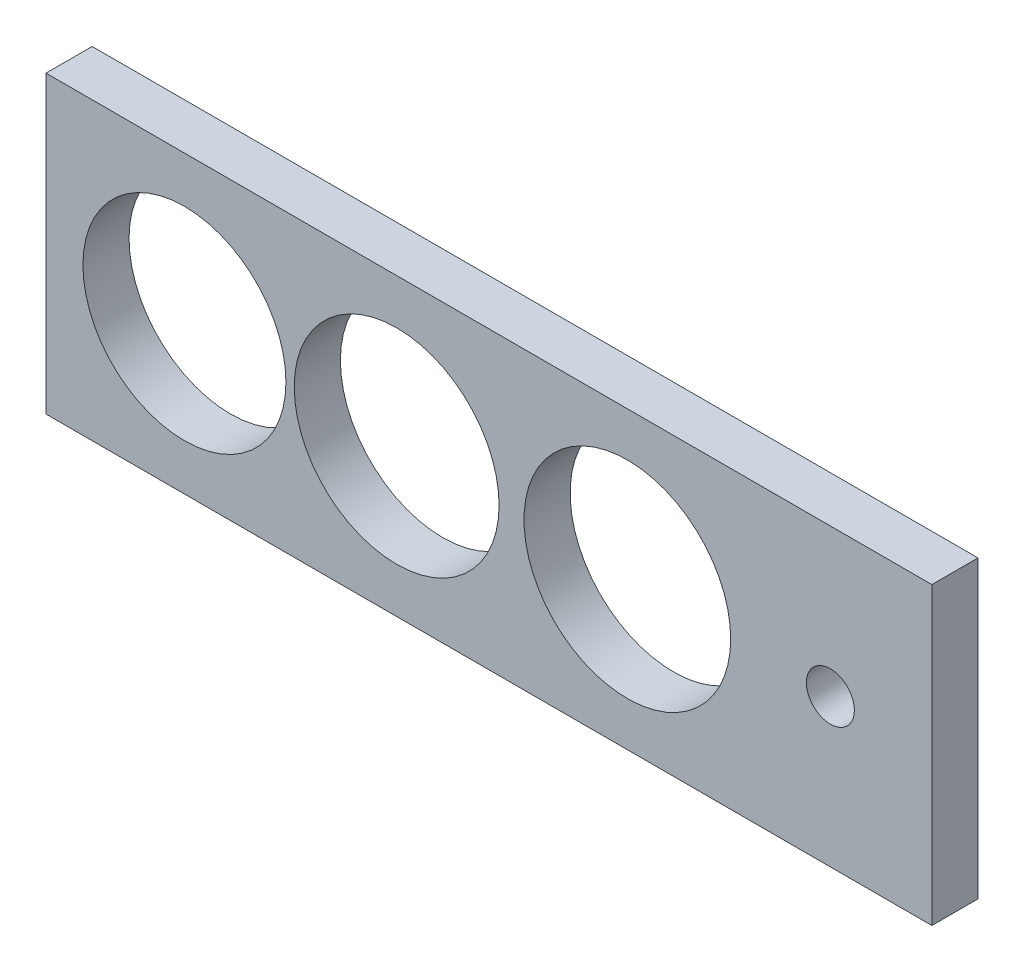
ISO-10303-21;
HEADER;
FILE_DESCRIPTION(('STEP AP214'),'2;1');
FILE_NAME('part.step','',(''),(''),'','','');
FILE_SCHEMA(('AUTOMOTIVE_DESIGN { 1 0 10303 214 1 1 1 1 }'));
ENDSEC;
DATA;
#1=APPLICATION_CONTEXT('core data for automotive mechanical design processes');
#2=APPLICATION_PROTOCOL_DEFINITION('international standard','automotive_design',2000,#1);
#3=PRODUCT_CONTEXT('',#1,'mechanical');
#4=PRODUCT('Part','Part','',(#3));
#5=PRODUCT_RELATED_PRODUCT_CATEGORY('part','',(#4));
#6=PRODUCT_DEFINITION_FORMATION('','',#4);
#7=PRODUCT_DEFINITION_CONTEXT('part definition',#1,'design');
#8=PRODUCT_DEFINITION('design','',#6,#7);
#9=PRODUCT_DEFINITION_SHAPE('','',#8);
#10=(LENGTH_UNIT() NAMED_UNIT(*) SI_UNIT(.MILLI.,.METRE.));
#11=(NAMED_UNIT(*) PLANE_ANGLE_UNIT() SI_UNIT($,.RADIAN.));
#12=(NAMED_UNIT(*) SI_UNIT($,.STERADIAN.) SOLID_ANGLE_UNIT());
#13=UNCERTAINTY_MEASURE_WITH_UNIT(LENGTH_MEASURE(1.E-05),#10,'distance_accuracy_value','');
#14=(GEOMETRIC_REPRESENTATION_CONTEXT(3) GLOBAL_UNCERTAINTY_ASSIGNED_CONTEXT((#13)) GLOBAL_UNIT_ASSIGNED_CONTEXT((#10,
#11,#12)) REPRESENTATION_CONTEXT('',''));
#15=CARTESIAN_POINT('',(0.,0.,0.));
#16=DIRECTION('',(0.,0.,1.));
#17=DIRECTION('',(1.,0.,0.));
#18=AXIS2_PLACEMENT_3D('',#15,#16,#17);
#19=CARTESIAN_POINT('',(37.,0.,0.));
#20=DIRECTION('',(0.,0.,-1.));
#21=DIRECTION('',(1.,0.,0.));
#22=AXIS2_PLACEMENT_3D('',#19,#20,#21);
#23=CYLINDRICAL_SURFACE('',#22,2.6);
#24=CARTESIAN_POINT('',(37.,0.,5.));
#25=DIRECTION('',(0.,0.,1.));
#26=DIRECTION('',(1.,0.,0.));
#27=AXIS2_PLACEMENT_3D('',#24,#25,#26);
#28=CIRCLE('',#27,2.6);
#29=CARTESIAN_POINT('',(39.6,0.,5.));
#30=VERTEX_POINT('',#29);
#31=EDGE_CURVE('E106',#30,#30,#28,.T.);
#32=ORIENTED_EDGE('',*,*,#31,.T.);
#33=EDGE_LOOP('',(#32));
#34=FACE_BOUND('',#33,.T.);
#35=CARTESIAN_POINT('',(37.,0.,0.));
#36=DIRECTION('',(0.,0.,1.));
#37=DIRECTION('',(1.,0.,0.));
#38=AXIS2_PLACEMENT_3D('',#35,#36,#37);
#39=CIRCLE('',#38,2.6);
#40=CARTESIAN_POINT('',(39.6,0.,0.));
#41=VERTEX_POINT('',#40);
#42=EDGE_CURVE('E10',#41,#41,#39,.T.);
#43=ORIENTED_EDGE('',*,*,#42,.F.);
#44=EDGE_LOOP('',(#43));
#45=FACE_BOUND('',#44,.T.);
#46=ADVANCED_FACE('F16',(#34,#45),#23,.F.);
#47=CARTESIAN_POINT('',(15.,0.,0.));
#48=DIRECTION('',(0.,0.,-1.));
#49=DIRECTION('',(1.,0.,0.));
#50=AXIS2_PLACEMENT_3D('',#47,#48,#49);
#51=CYLINDRICAL_SURFACE('',#50,11.2);
#52=CARTESIAN_POINT('',(15.,0.,5.));
#53=DIRECTION('',(0.,0.,1.));
#54=DIRECTION('',(1.,0.,0.));
#55=AXIS2_PLACEMENT_3D('',#52,#53,#54);
#56=CIRCLE('',#55,11.2);
#57=CARTESIAN_POINT('',(26.2,0.,5.));
#58=VERTEX_POINT('',#57);
#59=EDGE_CURVE('E109',#58,#58,#56,.T.);
#60=ORIENTED_EDGE('',*,*,#59,.T.);
#61=EDGE_LOOP('',(#60));
#62=FACE_BOUND('',#61,.T.);
#63=CARTESIAN_POINT('',(15.,0.,0.));
#64=DIRECTION('',(0.,0.,1.));
#65=DIRECTION('',(1.,0.,0.));
#66=AXIS2_PLACEMENT_3D('',#63,#64,#65);
#67=CIRCLE('',#66,11.2);
#68=CARTESIAN_POINT('',(26.2,0.,0.));
#69=VERTEX_POINT('',#68);
#70=EDGE_CURVE('E25',#69,#69,#67,.T.);
#71=ORIENTED_EDGE('',*,*,#70,.F.);
#72=EDGE_LOOP('',(#71));
#73=FACE_BOUND('',#72,.T.);
#74=ADVANCED_FACE('F18',(#62,#73),#51,.F.);
#75=CARTESIAN_POINT('',(-10.,0.,0.));
#76=DIRECTION('',(0.,0.,-1.));
#77=DIRECTION('',(1.,0.,0.));
#78=AXIS2_PLACEMENT_3D('',#75,#76,#77);
#79=CYLINDRICAL_SURFACE('',#78,11.1);
#80=CARTESIAN_POINT('',(-10.,0.,5.));
#81=DIRECTION('',(0.,0.,1.));
#82=DIRECTION('',(1.,0.,0.));
#83=AXIS2_PLACEMENT_3D('',#80,#81,#82);
#84=CIRCLE('',#83,11.1);
#85=CARTESIAN_POINT('',(1.1,0.,5.));
#86=VERTEX_POINT('',#85);
#87=EDGE_CURVE('E112',#86,#86,#84,.T.);
#88=ORIENTED_EDGE('',*,*,#87,.T.);
#89=EDGE_LOOP('',(#88));
#90=FACE_BOUND('',#89,.T.);
#91=CARTESIAN_POINT('',(-10.,0.,0.));
#92=DIRECTION('',(0.,0.,1.));
#93=DIRECTION('',(1.,0.,0.));
#94=AXIS2_PLACEMENT_3D('',#91,#92,#93);
#95=CIRCLE('',#94,11.1);
#96=CARTESIAN_POINT('',(1.1,0.,0.));
#97=VERTEX_POINT('',#96);
#98=EDGE_CURVE('E142',#97,#97,#95,.T.);
#99=ORIENTED_EDGE('',*,*,#98,.F.);
#100=EDGE_LOOP('',(#99));
#101=FACE_BOUND('',#100,.T.);
#102=ADVANCED_FACE('F152',(#90,#101),#79,.F.);
#103=CARTESIAN_POINT('',(-33.,0.,0.));
#104=DIRECTION('',(0.,0.,-1.));
#105=DIRECTION('',(1.,0.,0.));
#106=AXIS2_PLACEMENT_3D('',#103,#104,#105);
#107=CYLINDRICAL_SURFACE('',#106,11.);
#108=CARTESIAN_POINT('',(-33.,0.,5.));
#109=DIRECTION('',(0.,0.,1.));
#110=DIRECTION('',(1.,0.,0.));
#111=AXIS2_PLACEMENT_3D('',#108,#109,#110);
#112=CIRCLE('',#111,11.);
#113=CARTESIAN_POINT('',(-22.,0.,5.));
#114=VERTEX_POINT('',#113);
#115=EDGE_CURVE('E111',#114,#114,#112,.T.);
#116=ORIENTED_EDGE('',*,*,#115,.T.);
#117=EDGE_LOOP('',(#116));
#118=FACE_BOUND('',#117,.T.);
#119=CARTESIAN_POINT('',(-33.,0.,0.));
#120=DIRECTION('',(0.,0.,1.));
#121=DIRECTION('',(1.,0.,0.));
#122=AXIS2_PLACEMENT_3D('',#119,#120,#121);
#123=CIRCLE('',#122,11.);
#124=CARTESIAN_POINT('',(-22.,0.,0.));
#125=VERTEX_POINT('',#124);
#126=EDGE_CURVE('E130',#125,#125,#123,.T.);
#127=ORIENTED_EDGE('',*,*,#126,.F.);
#128=EDGE_LOOP('',(#127));
#129=FACE_BOUND('',#128,.T.);
#130=ADVANCED_FACE('F161',(#118,#129),#107,.F.);
#131=CARTESIAN_POINT('',(48.,-16.,0.));
#132=DIRECTION('',(1.,0.,0.));
#133=DIRECTION('',(0.,1.,0.));
#134=AXIS2_PLACEMENT_3D('',#131,#132,#133);
#135=PLANE('',#134);
#136=DIRECTION('',(0.,0.,1.));
#137=VECTOR('',#136,1.);
#138=CARTESIAN_POINT('',(48.,-16.,0.));
#139=LINE('',#138,#137);
#140=CARTESIAN_POINT('',(48.,-16.,0.));
#141=VERTEX_POINT('',#140);
#142=CARTESIAN_POINT('',(48.,-16.,5.));
#143=VERTEX_POINT('',#142);
#144=EDGE_CURVE('E80',#141,#143,#139,.T.);
#145=ORIENTED_EDGE('',*,*,#144,.F.);
#146=DIRECTION('',(0.,1.,0.));
#147=VECTOR('',#146,1.);
#148=CARTESIAN_POINT('',(48.,-16.,0.));
#149=LINE('',#148,#147);
#150=CARTESIAN_POINT('',(48.,16.,0.));
#151=VERTEX_POINT('',#150);
#152=EDGE_CURVE('E40',#141,#151,#149,.T.);
#153=ORIENTED_EDGE('',*,*,#152,.T.);
#154=DIRECTION('',(0.,0.,1.));
#155=VECTOR('',#154,1.);
#156=CARTESIAN_POINT('',(48.,16.,0.));
#157=LINE('',#156,#155);
#158=CARTESIAN_POINT('',(48.,16.,5.));
#159=VERTEX_POINT('',#158);
#160=EDGE_CURVE('E43',#151,#159,#157,.T.);
#161=ORIENTED_EDGE('',*,*,#160,.T.);
#162=DIRECTION('',(0.,1.,0.));
#163=VECTOR('',#162,1.);
#164=CARTESIAN_POINT('',(48.,-16.,5.));
#165=LINE('',#164,#163);
#166=EDGE_CURVE('E124',#143,#159,#165,.T.);
#167=ORIENTED_EDGE('',*,*,#166,.F.);
#168=EDGE_LOOP('',(#145,#153,#161,#167));
#169=FACE_BOUND('',#168,.T.);
#170=ADVANCED_FACE('F176',(#169),#135,.T.);
#171=CARTESIAN_POINT('',(-48.,-16.,0.));
#172=DIRECTION('',(0.,0.,1.));
#173=DIRECTION('',(1.,0.,0.));
#174=AXIS2_PLACEMENT_3D('',#171,#172,#173);
#175=PLANE('',#174);
#176=ORIENTED_EDGE('',*,*,#42,.T.);
#177=EDGE_LOOP('',(#176));
#178=FACE_BOUND('',#177,.T.);
#179=ORIENTED_EDGE('',*,*,#70,.T.);
#180=EDGE_LOOP('',(#179));
#181=FACE_BOUND('',#180,.T.);
#182=ORIENTED_EDGE('',*,*,#98,.T.);
#183=EDGE_LOOP('',(#182));
#184=FACE_BOUND('',#183,.T.);
#185=ORIENTED_EDGE('',*,*,#126,.T.);
#186=EDGE_LOOP('',(#185));
#187=FACE_BOUND('',#186,.T.);
#188=DIRECTION('',(1.,0.,0.));
#189=VECTOR('',#188,1.);
#190=CARTESIAN_POINT('',(-48.,16.,0.));
#191=LINE('',#190,#189);
#192=CARTESIAN_POINT('',(-48.,16.,0.));
#193=VERTEX_POINT('',#192);
#194=EDGE_CURVE('E108',#193,#151,#191,.T.);
#195=ORIENTED_EDGE('',*,*,#194,.T.);
#196=ORIENTED_EDGE('',*,*,#152,.F.);
#197=DIRECTION('',(1.,0.,0.));
#198=VECTOR('',#197,1.);
#199=CARTESIAN_POINT('',(-48.,-16.,0.));
#200=LINE('',#199,#198);
#201=CARTESIAN_POINT('',(-48.,-16.,0.));
#202=VERTEX_POINT('',#201);
#203=EDGE_CURVE('E85',#202,#141,#200,.T.);
#204=ORIENTED_EDGE('',*,*,#203,.F.);
#205=DIRECTION('',(0.,1.,0.));
#206=VECTOR('',#205,1.);
#207=CARTESIAN_POINT('',(-48.,-16.,0.));
#208=LINE('',#207,#206);
#209=EDGE_CURVE('E89',#202,#193,#208,.T.);
#210=ORIENTED_EDGE('',*,*,#209,.T.);
#211=EDGE_LOOP('',(#195,#196,#204,#210));
#212=FACE_BOUND('',#211,.T.);
#213=ADVANCED_FACE('F147',(#178,#181,#184,#187,#212),#175,.F.);
#214=CARTESIAN_POINT('',(-48.,16.,0.));
#215=DIRECTION('',(0.,1.,0.));
#216=DIRECTION('',(1.,0.,0.));
#217=AXIS2_PLACEMENT_3D('',#214,#215,#216);
#218=PLANE('',#217);
#219=ORIENTED_EDGE('',*,*,#194,.F.);
#220=DIRECTION('',(0.,0.,1.));
#221=VECTOR('',#220,1.);
#222=CARTESIAN_POINT('',(-48.,16.,0.));
#223=LINE('',#222,#221);
#224=CARTESIAN_POINT('',(-48.,16.,5.));
#225=VERTEX_POINT('',#224);
#226=EDGE_CURVE('E100',#193,#225,#223,.T.);
#227=ORIENTED_EDGE('',*,*,#226,.T.);
#228=DIRECTION('',(1.,0.,0.));
#229=VECTOR('',#228,1.);
#230=CARTESIAN_POINT('',(-48.,16.,5.));
#231=LINE('',#230,#229);
#232=EDGE_CURVE('E94',#225,#159,#231,.T.);
#233=ORIENTED_EDGE('',*,*,#232,.T.);
#234=ORIENTED_EDGE('',*,*,#160,.F.);
#235=EDGE_LOOP('',(#219,#227,#233,#234));
#236=FACE_BOUND('',#235,.T.);
#237=ADVANCED_FACE('F168',(#236),#218,.T.);
#238=CARTESIAN_POINT('',(-48.,-16.,5.));
#239=DIRECTION('',(0.,0.,1.));
#240=DIRECTION('',(1.,0.,0.));
#241=AXIS2_PLACEMENT_3D('',#238,#239,#240);
#242=PLANE('',#241);
#243=ORIENTED_EDGE('',*,*,#31,.F.);
#244=EDGE_LOOP('',(#243));
#245=FACE_BOUND('',#244,.T.);
#246=ORIENTED_EDGE('',*,*,#59,.F.);
#247=EDGE_LOOP('',(#246));
#248=FACE_BOUND('',#247,.T.);
#249=ORIENTED_EDGE('',*,*,#87,.F.);
#250=EDGE_LOOP('',(#249));
#251=FACE_BOUND('',#250,.T.);
#252=ORIENTED_EDGE('',*,*,#115,.F.);
#253=EDGE_LOOP('',(#252));
#254=FACE_BOUND('',#253,.T.);
#255=DIRECTION('',(0.,1.,0.));
#256=VECTOR('',#255,1.);
#257=CARTESIAN_POINT('',(-48.,-16.,5.));
#258=LINE('',#257,#256);
#259=CARTESIAN_POINT('',(-48.,-16.,5.));
#260=VERTEX_POINT('',#259);
#261=EDGE_CURVE('E86',#260,#225,#258,.T.);
#262=ORIENTED_EDGE('',*,*,#261,.F.);
#263=DIRECTION('',(1.,0.,0.));
#264=VECTOR('',#263,1.);
#265=CARTESIAN_POINT('',(-48.,-16.,5.));
#266=LINE('',#265,#264);
#267=EDGE_CURVE('E75',#260,#143,#266,.T.);
#268=ORIENTED_EDGE('',*,*,#267,.T.);
#269=ORIENTED_EDGE('',*,*,#166,.T.);
#270=ORIENTED_EDGE('',*,*,#232,.F.);
#271=EDGE_LOOP('',(#262,#268,#269,#270));
#272=FACE_BOUND('',#271,.T.);
#273=ADVANCED_FACE('F91',(#245,#248,#251,#254,#272),#242,.T.);
#274=CARTESIAN_POINT('',(-48.,-16.,0.));
#275=DIRECTION('',(0.,1.,0.));
#276=DIRECTION('',(1.,0.,0.));
#277=AXIS2_PLACEMENT_3D('',#274,#275,#276);
#278=PLANE('',#277);
#279=ORIENTED_EDGE('',*,*,#144,.T.);
#280=ORIENTED_EDGE('',*,*,#267,.F.);
#281=DIRECTION('',(0.,0.,1.));
#282=VECTOR('',#281,1.);
#283=CARTESIAN_POINT('',(-48.,-16.,0.));
#284=LINE('',#283,#282);
#285=EDGE_CURVE('E74',#202,#260,#284,.T.);
#286=ORIENTED_EDGE('',*,*,#285,.F.);
#287=ORIENTED_EDGE('',*,*,#203,.T.);
#288=EDGE_LOOP('',(#279,#280,#286,#287));
#289=FACE_BOUND('',#288,.T.);
#290=ADVANCED_FACE('F73',(#289),#278,.F.);
#291=CARTESIAN_POINT('',(-48.,-16.,0.));
#292=DIRECTION('',(1.,0.,0.));
#293=DIRECTION('',(0.,1.,0.));
#294=AXIS2_PLACEMENT_3D('',#291,#292,#293);
#295=PLANE('',#294);
#296=ORIENTED_EDGE('',*,*,#261,.T.);
#297=ORIENTED_EDGE('',*,*,#226,.F.);
#298=ORIENTED_EDGE('',*,*,#209,.F.);
#299=ORIENTED_EDGE('',*,*,#285,.T.);
#300=EDGE_LOOP('',(#296,#297,#298,#299));
#301=FACE_BOUND('',#300,.T.);
#302=ADVANCED_FACE('F88',(#301),#295,.F.);
#303=CLOSED_SHELL('',(#46,#74,#102,#130,#170,#213,#237,#273,#290,#302));
#304=MANIFOLD_SOLID_BREP('B1',#303);
#305=ADVANCED_BREP_SHAPE_REPRESENTATION('',(#18,#304),#14);
#306=SHAPE_DEFINITION_REPRESENTATION(#9,#305);
ENDSEC;
END-ISO-10303-21;
